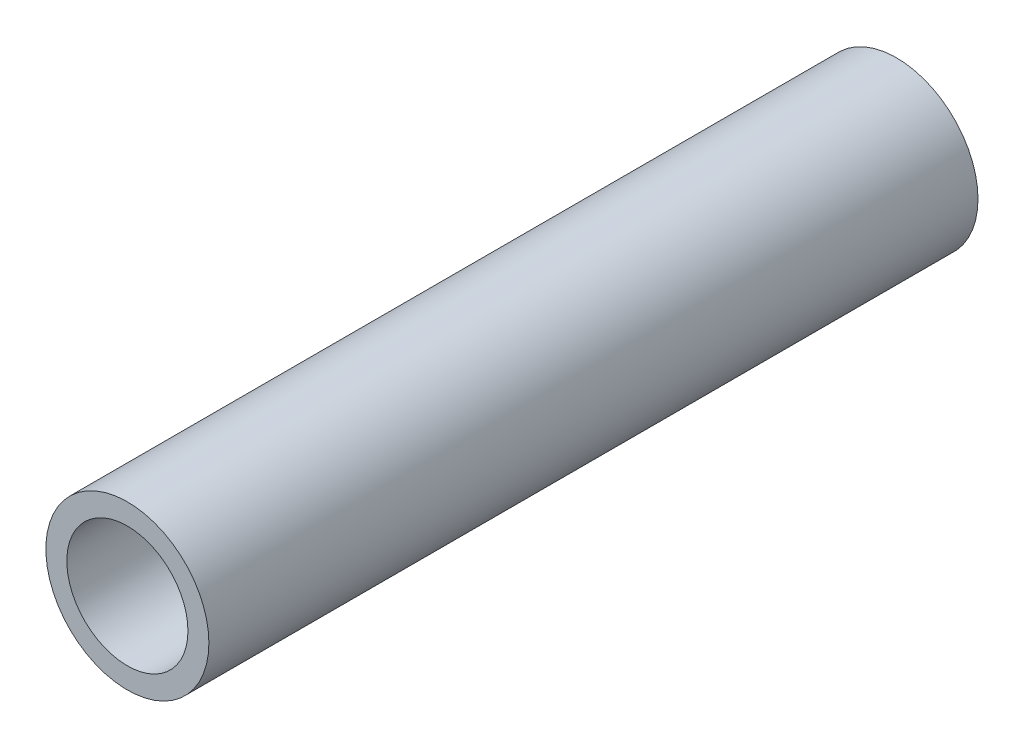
ISO-10303-21;
HEADER;
FILE_DESCRIPTION(('STEP AP214'),'2;1');
FILE_NAME('part.step','',(''),(''),'','','');
FILE_SCHEMA(('AUTOMOTIVE_DESIGN { 1 0 10303 214 1 1 1 1 }'));
ENDSEC;
DATA;
#1=APPLICATION_CONTEXT('core data for automotive mechanical design processes');
#2=APPLICATION_PROTOCOL_DEFINITION('international standard','automotive_design',2000,#1);
#3=PRODUCT_CONTEXT('',#1,'mechanical');
#4=PRODUCT('Part','Part','',(#3));
#5=PRODUCT_RELATED_PRODUCT_CATEGORY('part','',(#4));
#6=PRODUCT_DEFINITION_FORMATION('','',#4);
#7=PRODUCT_DEFINITION_CONTEXT('part definition',#1,'design');
#8=PRODUCT_DEFINITION('design','',#6,#7);
#9=PRODUCT_DEFINITION_SHAPE('','',#8);
#10=(LENGTH_UNIT() NAMED_UNIT(*) SI_UNIT(.MILLI.,.METRE.));
#11=(NAMED_UNIT(*) PLANE_ANGLE_UNIT() SI_UNIT($,.RADIAN.));
#12=(NAMED_UNIT(*) SI_UNIT($,.STERADIAN.) SOLID_ANGLE_UNIT());
#13=UNCERTAINTY_MEASURE_WITH_UNIT(LENGTH_MEASURE(1.E-05),#10,'distance_accuracy_value','');
#14=(GEOMETRIC_REPRESENTATION_CONTEXT(3) GLOBAL_UNCERTAINTY_ASSIGNED_CONTEXT((#13)) GLOBAL_UNIT_ASSIGNED_CONTEXT((#10,
#11,#12)) REPRESENTATION_CONTEXT('',''));
#15=CARTESIAN_POINT('',(0.,0.,0.));
#16=DIRECTION('',(0.,0.,1.));
#17=DIRECTION('',(1.,0.,0.));
#18=AXIS2_PLACEMENT_3D('',#15,#16,#17);
#19=CARTESIAN_POINT('',(0.,0.,50.8));
#20=DIRECTION('',(0.,0.,1.));
#21=DIRECTION('',(1.,0.,0.));
#22=AXIS2_PLACEMENT_3D('',#19,#20,#21);
#23=PLANE('',#22);
#24=CARTESIAN_POINT('',(0.,0.,50.8));
#25=DIRECTION('',(0.,0.,1.));
#26=DIRECTION('',(1.,0.,0.));
#27=AXIS2_PLACEMENT_3D('',#24,#25,#26);
#28=CIRCLE('',#27,10.7696);
#29=CARTESIAN_POINT('',(10.7696,0.,50.8));
#30=VERTEX_POINT('',#29);
#31=EDGE_CURVE('E10',#30,#30,#28,.T.);
#32=ORIENTED_EDGE('',*,*,#31,.T.);
#33=EDGE_LOOP('',(#32));
#34=FACE_BOUND('',#33,.T.);
#35=CARTESIAN_POINT('',(0.,0.,50.8));
#36=DIRECTION('',(0.,0.,1.));
#37=DIRECTION('',(1.,0.,0.));
#38=AXIS2_PLACEMENT_3D('',#35,#36,#37);
#39=CIRCLE('',#38,8.001);
#40=CARTESIAN_POINT('',(8.001,0.,50.8));
#41=VERTEX_POINT('',#40);
#42=EDGE_CURVE('E42',#41,#41,#39,.T.);
#43=ORIENTED_EDGE('',*,*,#42,.F.);
#44=EDGE_LOOP('',(#43));
#45=FACE_BOUND('',#44,.T.);
#46=ADVANCED_FACE('F31',(#34,#45),#23,.T.);
#47=CARTESIAN_POINT('',(0.,0.,-50.8));
#48=DIRECTION('',(0.,0.,1.));
#49=DIRECTION('',(1.,0.,0.));
#50=AXIS2_PLACEMENT_3D('',#47,#48,#49);
#51=PLANE('',#50);
#52=CARTESIAN_POINT('',(0.,0.,-50.8));
#53=DIRECTION('',(0.,0.,1.));
#54=DIRECTION('',(1.,0.,0.));
#55=AXIS2_PLACEMENT_3D('',#52,#53,#54);
#56=CIRCLE('',#55,10.7696);
#57=CARTESIAN_POINT('',(10.7696,0.,-50.8));
#58=VERTEX_POINT('',#57);
#59=EDGE_CURVE('E35',#58,#58,#56,.T.);
#60=ORIENTED_EDGE('',*,*,#59,.F.);
#61=EDGE_LOOP('',(#60));
#62=FACE_BOUND('',#61,.T.);
#63=CARTESIAN_POINT('',(0.,0.,-50.8));
#64=DIRECTION('',(0.,0.,1.));
#65=DIRECTION('',(1.,0.,0.));
#66=AXIS2_PLACEMENT_3D('',#63,#64,#65);
#67=CIRCLE('',#66,8.001);
#68=CARTESIAN_POINT('',(8.001,0.,-50.8));
#69=VERTEX_POINT('',#68);
#70=EDGE_CURVE('E44',#69,#69,#67,.T.);
#71=ORIENTED_EDGE('',*,*,#70,.T.);
#72=EDGE_LOOP('',(#71));
#73=FACE_BOUND('',#72,.T.);
#74=ADVANCED_FACE('F54',(#62,#73),#51,.F.);
#75=CARTESIAN_POINT('',(0.,0.,50.8));
#76=DIRECTION('',(0.,0.,-1.));
#77=DIRECTION('',(-1.,0.,0.));
#78=AXIS2_PLACEMENT_3D('',#75,#76,#77);
#79=CYLINDRICAL_SURFACE('',#78,10.7696);
#80=ORIENTED_EDGE('',*,*,#31,.F.);
#81=EDGE_LOOP('',(#80));
#82=FACE_BOUND('',#81,.T.);
#83=ORIENTED_EDGE('',*,*,#59,.T.);
#84=EDGE_LOOP('',(#83));
#85=FACE_BOUND('',#84,.T.);
#86=ADVANCED_FACE('F33',(#82,#85),#79,.T.);
#87=CARTESIAN_POINT('',(0.,0.,50.8));
#88=DIRECTION('',(0.,0.,-1.));
#89=DIRECTION('',(-1.,0.,0.));
#90=AXIS2_PLACEMENT_3D('',#87,#88,#89);
#91=CYLINDRICAL_SURFACE('',#90,8.001);
#92=ORIENTED_EDGE('',*,*,#42,.T.);
#93=EDGE_LOOP('',(#92));
#94=FACE_BOUND('',#93,.T.);
#95=ORIENTED_EDGE('',*,*,#70,.F.);
#96=EDGE_LOOP('',(#95));
#97=FACE_BOUND('',#96,.T.);
#98=ADVANCED_FACE('F50',(#94,#97),#91,.F.);
#99=CLOSED_SHELL('',(#46,#74,#86,#98));
#100=MANIFOLD_SOLID_BREP('B2',#99);
#101=ADVANCED_BREP_SHAPE_REPRESENTATION('',(#18,#100),#14);
#102=SHAPE_DEFINITION_REPRESENTATION(#9,#101);
ENDSEC;
END-ISO-10303-21;
